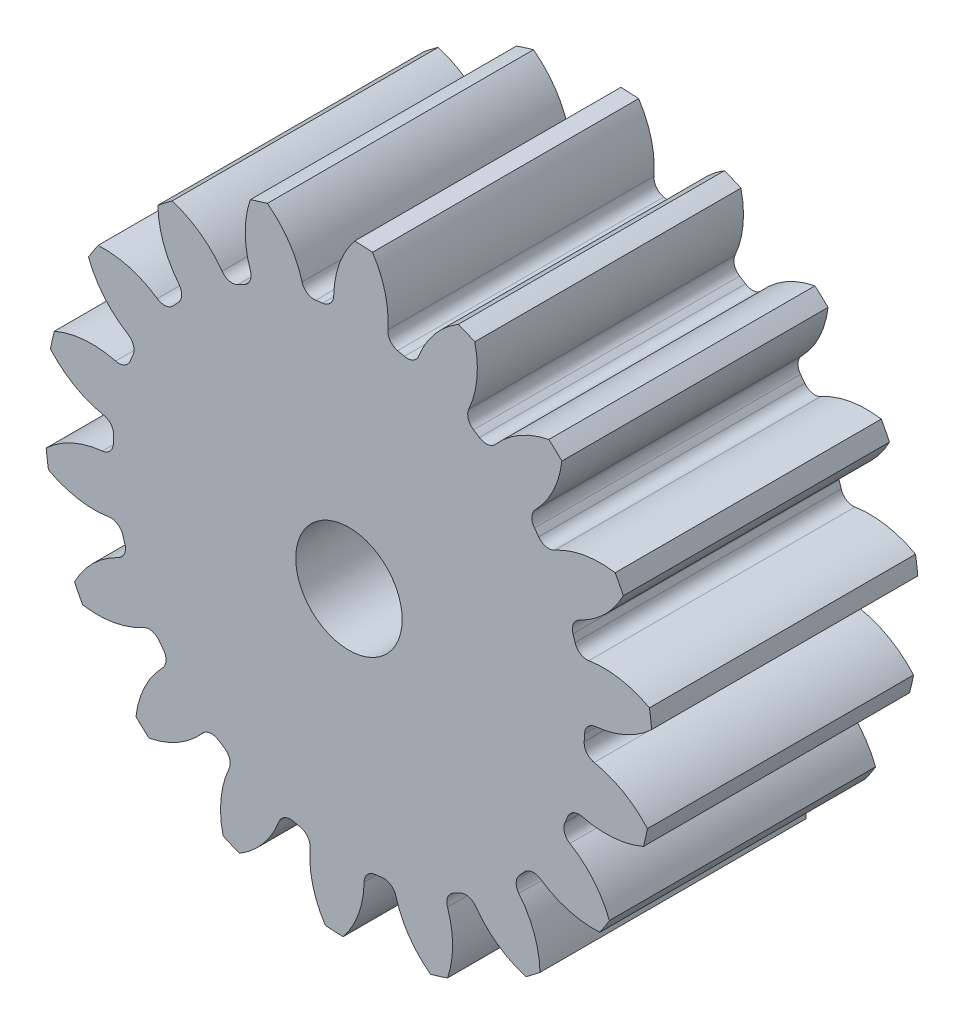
from build123d import *

# Parameters (mm, degrees)
SKETCH3_R         = 101.6
GEARBODY_DEPTH    = 88.9
TOOTHCUT_DEPTH    = 169.962510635
CIRPATTERN1_COUNT = 18
BOREDIA_R         = 17.78
BORE_DEPTH        = 12700


with BuildPart() as part:
    # Sketch3 → gearBody (new body)
    with BuildSketch(Plane.XY):
        Circle(SKETCH3_R)
    extrude(amount=GEARBODY_DEPTH)

    # Sketch2 → toothCut (cut, through all)
    with BuildSketch(Plane.XY):
        with BuildLine():
            ThreePointArc((78.583555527, -4.961088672), (78.648423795, -3.79645025), (78.696032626, -2.630978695))
            ThreePointArc((78.696032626, -2.630978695), (79.814396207, 0.061457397), (82.43122895, 1.346811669))
            ThreePointArc((82.43122895, 1.346811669), (92.78436945, 4.173082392), (101.6, 10.293538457))
            ThreePointArc((101.6, 10.293538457), (102.001342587, -4.923722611), (100.13617168, -20.031576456))
            ThreePointArc((100.13617168, -20.031576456), (91.951037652, -13.09047385), (81.918253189, -9.280150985))
            ThreePointArc((81.918253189, -9.280150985), (79.437389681, -7.748725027), (78.583555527, -4.961088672))
        make_face()
    toothcut = extrude(amount=TOOTHCUT_DEPTH, mode=Mode.SUBTRACT)

    # CirPattern1: toothCut ×18 about axis
    cirpattern1_axis = Axis((0, 0, 0), (0, 0, 1))
    for i in range(1, CIRPATTERN1_COUNT):
        add(toothcut.rotate(cirpattern1_axis, i * 360 / CIRPATTERN1_COUNT), mode=Mode.SUBTRACT)

    # boreDia → bore (cut, symmetric)
    with BuildSketch(Plane.XY):
        Circle(BOREDIA_R)
    extrude(amount=BORE_DEPTH, both=True, mode=Mode.SUBTRACT)


solid = part.part
